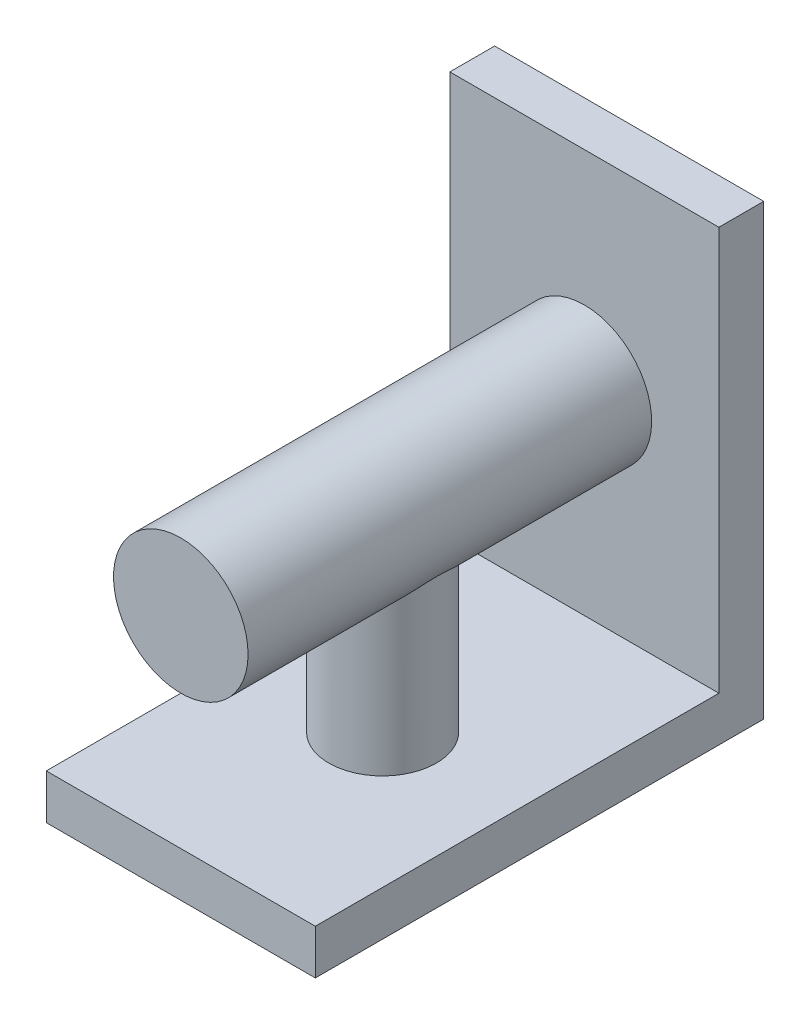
from build123d import *

# Parameters (mm, degrees)
EXTRUDE1_DEPTH      = 15
SKETCH2_R           = 7.5
EXTRUDE2_DEPTH      = 45
EXTRUDE3_REACH      = 70.92
EXTRUDE3_END_RADIUS = 7.5
SKETCH3_R           = 6


with BuildPart() as part:
    # Sketch1 → Extrude1 (new, symmetric)
    with BuildSketch(Plane(origin=(0, 0, 0), x_dir=(0, 0, -1), z_dir=(1, 0, 0))):
        Polygon((0, 0), (50, 0), (50, 50), (45, 50), (45, 5), (0, 5), align=None)
    extrude(amount=EXTRUDE1_DEPTH, both=True)

    # Sketch2 → Extrude2 (add, through all)
    with BuildSketch(Plane.XY.offset(-45)):
        with Locations(Location((0, 27.5, 0), (0, 0, 90))):
            Circle(SKETCH2_R)
    extrude(amount=EXTRUDE2_DEPTH)

    # Extrude3: up to this cylinder (the profile starts outside it)
    extrude3_end = Plane(origin=(0, 27.5, -22.5), z_dir=(0, 0, -1)) * Cylinder(EXTRUDE3_END_RADIUS, 157.84, mode=Mode.PRIVATE)
    # Sketch3 → Extrude3 (add, up to the surface)
    with BuildSketch(Plane(origin=(0, 5, 0), x_dir=(-1, 0, 0), z_dir=(0, 1, 0)), mode=Mode.PRIVATE) as extrude3_sk1:
        with Locations(Location((0, -22.5, 0), (0, 0, 270))):
            Circle(SKETCH3_R)
    extrude3_tool1 = extrude(extrude3_sk1.sketch, amount=EXTRUDE3_REACH, mode=Mode.PRIVATE) - extrude3_end
    add(extrude3_tool1.solids().sort_by_distance((0, 5, -22.5))[0])


solid = part.part
